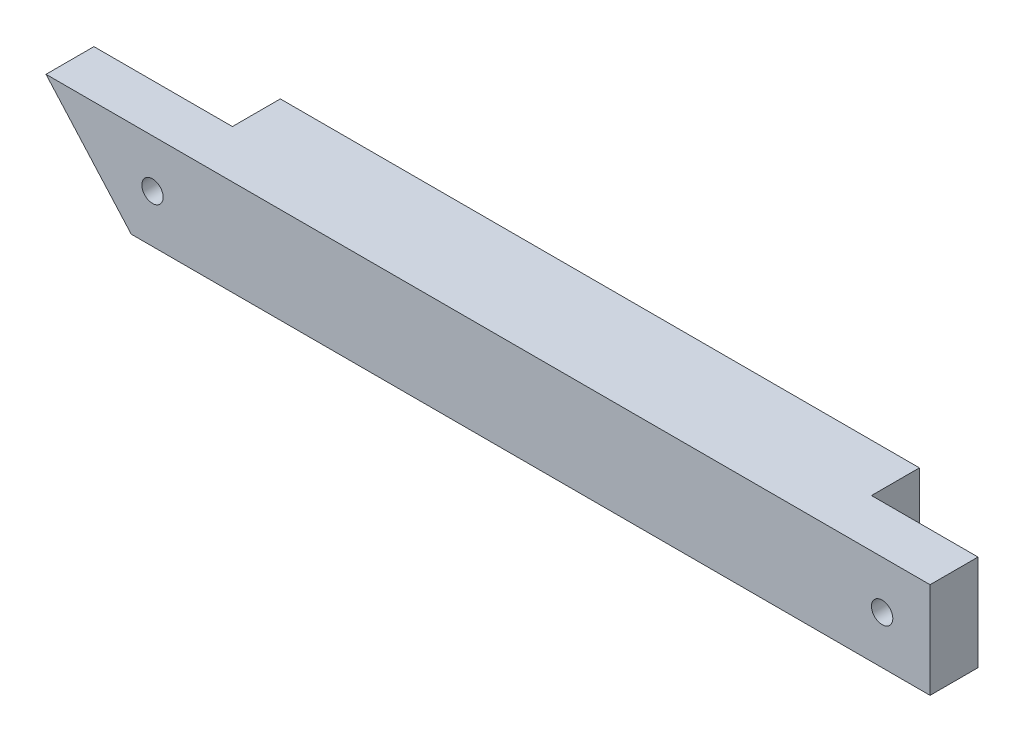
from build123d import *

# Parameters (mm, degrees)
ESQUISSE1_W             = 83
ESQUISSE1_H             = 9
EXTRUSION1_DEPTH        = 9
ESQUISSE2_W             = 10
ESQUISSE2_H             = 9
ENL_V_MAT_EXTRU_1_DEPTH = 4.5
ESQUISSE3_R             = 1
ENL_V_MAT_EXTRU_2_DEPTH = 4.5
ENL_V_MAT_EXTRU_3_DEPTH = 9
ENL_V_MAT_EXTRU_4_DEPTH = 4.5
ESQUISSE6_R             = 1
ENL_V_MAT_EXTRU_5_DEPTH = 4.5


with BuildPart() as part:
    # Esquisse1 → Extrusion1 (new body)
    with BuildSketch(Plane.XY):
        with Locations((41.5, 4.5)):
            Rectangle(ESQUISSE1_W, ESQUISSE1_H)
    extrude(amount=EXTRUSION1_DEPTH)

    # Esquisse2 → Enl_v. mat.-Extru.1 (cut)
    with BuildSketch(Plane(origin=(0, 0, 0), x_dir=(-1, 0, 0), z_dir=(0, 0, -1))):
        with Locations((-78, 4.5)):
            Rectangle(ESQUISSE2_W, ESQUISSE2_H)
    extrude(amount=-ENL_V_MAT_EXTRU_1_DEPTH, mode=Mode.SUBTRACT)

    # Esquisse3 → Enl_v. mat.-Extru.2 (cut)
    with BuildSketch(Plane(origin=(0, 0, 4.5), x_dir=(-1, 0, 0), z_dir=(0, 0, -1))):
        with Locations((-78.5, 4.5)):
            Circle(ESQUISSE3_R)
    extrude(amount=-ENL_V_MAT_EXTRU_2_DEPTH, mode=Mode.SUBTRACT)

    # Esquisse4 → Enl_v. mat.-Extru.3 (cut)
    with BuildSketch(Plane(origin=(0, 0, 0), x_dir=(-1, 0, 0), z_dir=(0, 0, -1))):
        Polygon((0, 9), (-8, 0), (0, 0), align=None)
    extrude(amount=-ENL_V_MAT_EXTRU_3_DEPTH, mode=Mode.SUBTRACT)

    # Esquisse5 → Enl_v. mat.-Extru.4 (cut)
    with BuildSketch(Plane(origin=(0, 0, 0), x_dir=(-1, 0, 0), z_dir=(0, 0, -1))):
        Polygon((0, 9), (-13, 9), (-21, 0), (-8, 0), align=None)
    extrude(amount=-ENL_V_MAT_EXTRU_4_DEPTH, mode=Mode.SUBTRACT)

    # Esquisse6 → Enl_v. mat.-Extru.5 (cut)
    with BuildSketch(Plane(origin=(0, 0, 4.5), x_dir=(-1, 0, 0), z_dir=(0, 0, -1))):
        with Locations((-10, 4.5)):
            Circle(ESQUISSE6_R)
    extrude(amount=-ENL_V_MAT_EXTRU_5_DEPTH, mode=Mode.SUBTRACT)


solid = part.part
